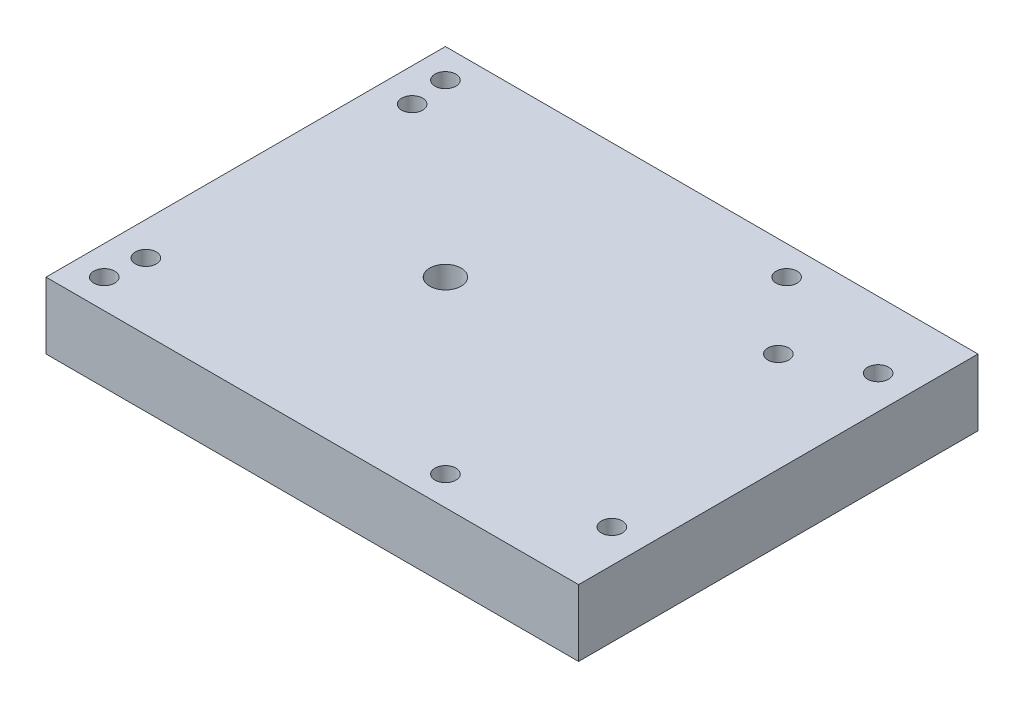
from build123d import *

# Parameters (mm, degrees)
SKETCH1_W           = 101.6
SKETCH1_H           = 76.2
BOSS_EXTRUDE1_DEPTH = 12.7
SKETCH2_R           = 3
CUT_EXTRUDE1_DEPTH  = 79.43650792
SKETCH3_R           = 2
CUT_EXTRUDE2_DEPTH  = 79.43650792
SKETCH4_R           = 2
CUT_EXTRUDE3_DEPTH  = 79.43650792
SKETCH5_R           = 2
CUT_EXTRUDE4_DEPTH  = 6.35


with BuildPart() as part:
    # Sketch1 → Boss-Extrude1 (new body)
    with BuildSketch(Plane(origin=(0, 0, 0), x_dir=(1, 0, 0), z_dir=(0, 1, 0))):
        with Locations((-8.839471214, -11.236895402)):
            Rectangle(SKETCH1_W, SKETCH1_H)
    extrude(amount=BOSS_EXTRUDE1_DEPTH)

    # Sketch2 → Cut-Extrude1 (cut, through all)
    with BuildSketch(Plane(origin=(0, 12.7, 0), x_dir=(1, 0, 0), z_dir=(0, 1, 0))):
        with Locations(Location((-21.539471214, -11.236895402, 0), (0, 0, 270))):
            Circle(SKETCH2_R)
    extrude(amount=-CUT_EXTRUDE1_DEPTH, mode=Mode.SUBTRACT)

    # Sketch3 → Cut-Extrude2 (cut, through all)
    with BuildSketch(Plane(origin=(0, 12.7, 0), x_dir=(1, 0, 0), z_dir=(0, 1, 0))):
        with Locations(Location((-53.289471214, 14.163104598, 0), (0, 0, 270))):
            Circle(SKETCH3_R)
        with Locations(Location((35.610528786, 14.163104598, 0), (0, 0, 270))):
            Circle(SKETCH3_R)
        with Locations(Location((35.610528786, -36.636895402, 0), (0, 0, 270))):
            Circle(SKETCH3_R)
        with Locations(Location((-53.289471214, -36.636895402, 0), (0, 0, 270))):
            Circle(SKETCH3_R)
    extrude(amount=-CUT_EXTRUDE2_DEPTH, mode=Mode.SUBTRACT)

    # Sketch4 → Cut-Extrude3 (cut, through all)
    with BuildSketch(Plane(origin=(0, 12.7, 0), x_dir=(1, 0, 0), z_dir=(0, 1, 0))):
        with Locations(Location((22.910528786, 7.813104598, 0), (0, 0, 270))):
            Circle(SKETCH4_R)
    extrude(amount=-CUT_EXTRUDE3_DEPTH, mode=Mode.SUBTRACT)

    # Sketch5 → Cut-Extrude4 (cut)
    with BuildSketch(Plane(origin=(0, 12.7, 0), x_dir=(-1, 0, 0), z_dir=(0, 1, 0))):
        with Locations(Location((54.083221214, -21.306854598, 0), (0, 0, 90))):
            Circle(SKETCH5_R)
        with Locations(Location((-11.004278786, -21.306854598, 0), (0, 0, 90))):
            Circle(SKETCH5_R)
        with Locations(Location((54.083221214, 43.780645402, 0), (0, 0, 90))):
            Circle(SKETCH5_R)
        with Locations(Location((-11.004278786, 43.780645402, 0), (0, 0, 90))):
            Circle(SKETCH5_R)
    extrude(amount=-CUT_EXTRUDE4_DEPTH, mode=Mode.SUBTRACT)


solid = part.part
